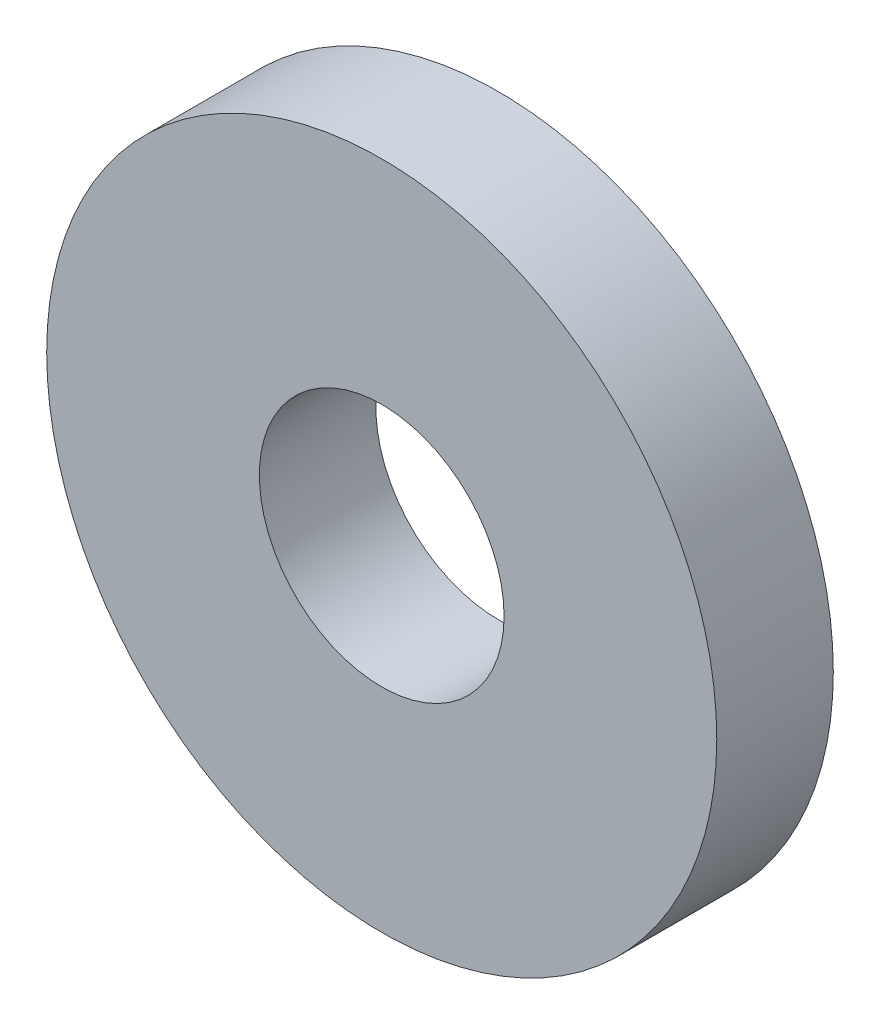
ISO-10303-21;
HEADER;
FILE_DESCRIPTION(('STEP AP214'),'2;1');
FILE_NAME('part.step','',(''),(''),'','','');
FILE_SCHEMA(('AUTOMOTIVE_DESIGN { 1 0 10303 214 1 1 1 1 }'));
ENDSEC;
DATA;
#1=APPLICATION_CONTEXT('core data for automotive mechanical design processes');
#2=APPLICATION_PROTOCOL_DEFINITION('international standard','automotive_design',2000,#1);
#3=PRODUCT_CONTEXT('',#1,'mechanical');
#4=PRODUCT('Part','Part','',(#3));
#5=PRODUCT_RELATED_PRODUCT_CATEGORY('part','',(#4));
#6=PRODUCT_DEFINITION_FORMATION('','',#4);
#7=PRODUCT_DEFINITION_CONTEXT('part definition',#1,'design');
#8=PRODUCT_DEFINITION('design','',#6,#7);
#9=PRODUCT_DEFINITION_SHAPE('','',#8);
#10=(LENGTH_UNIT() NAMED_UNIT(*) SI_UNIT(.MILLI.,.METRE.));
#11=(NAMED_UNIT(*) PLANE_ANGLE_UNIT() SI_UNIT($,.RADIAN.));
#12=(NAMED_UNIT(*) SI_UNIT($,.STERADIAN.) SOLID_ANGLE_UNIT());
#13=UNCERTAINTY_MEASURE_WITH_UNIT(LENGTH_MEASURE(1.E-05),#10,'distance_accuracy_value','');
#14=(GEOMETRIC_REPRESENTATION_CONTEXT(3) GLOBAL_UNCERTAINTY_ASSIGNED_CONTEXT((#13)) GLOBAL_UNIT_ASSIGNED_CONTEXT((#10,
#11,#12)) REPRESENTATION_CONTEXT('',''));
#15=CARTESIAN_POINT('',(0.,0.,0.));
#16=DIRECTION('',(0.,0.,1.));
#17=DIRECTION('',(1.,0.,0.));
#18=AXIS2_PLACEMENT_3D('',#15,#16,#17);
#19=CARTESIAN_POINT('',(0.,0.,4.));
#20=DIRECTION('',(0.,0.,1.));
#21=DIRECTION('',(1.,0.,0.));
#22=AXIS2_PLACEMENT_3D('',#19,#20,#21);
#23=PLANE('',#22);
#24=CARTESIAN_POINT('',(0.,0.,4.));
#25=DIRECTION('',(0.,0.,1.));
#26=DIRECTION('',(1.,0.,0.));
#27=AXIS2_PLACEMENT_3D('',#24,#25,#26);
#28=CIRCLE('',#27,11.5);
#29=CARTESIAN_POINT('',(11.5,0.,4.));
#30=VERTEX_POINT('',#29);
#31=EDGE_CURVE('E8',#30,#30,#28,.T.);
#32=ORIENTED_EDGE('',*,*,#31,.T.);
#33=EDGE_LOOP('',(#32));
#34=FACE_BOUND('',#33,.T.);
#35=CARTESIAN_POINT('',(0.,0.,4.));
#36=DIRECTION('',(0.,0.,1.));
#37=DIRECTION('',(1.,0.,0.));
#38=AXIS2_PLACEMENT_3D('',#35,#36,#37);
#39=CIRCLE('',#38,4.2);
#40=CARTESIAN_POINT('',(4.2,0.,4.));
#41=VERTEX_POINT('',#40);
#42=EDGE_CURVE('E23',#41,#41,#39,.T.);
#43=ORIENTED_EDGE('',*,*,#42,.F.);
#44=EDGE_LOOP('',(#43));
#45=FACE_BOUND('',#44,.T.);
#46=ADVANCED_FACE('F12',(#34,#45),#23,.T.);
#47=CARTESIAN_POINT('',(0.,0.,0.));
#48=DIRECTION('',(0.,0.,1.));
#49=DIRECTION('',(1.,0.,0.));
#50=AXIS2_PLACEMENT_3D('',#47,#48,#49);
#51=PLANE('',#50);
#52=CARTESIAN_POINT('',(0.,0.,0.));
#53=DIRECTION('',(0.,0.,1.));
#54=DIRECTION('',(1.,0.,0.));
#55=AXIS2_PLACEMENT_3D('',#52,#53,#54);
#56=CIRCLE('',#55,11.5);
#57=CARTESIAN_POINT('',(11.5,0.,0.));
#58=VERTEX_POINT('',#57);
#59=EDGE_CURVE('E19',#58,#58,#56,.T.);
#60=ORIENTED_EDGE('',*,*,#59,.F.);
#61=EDGE_LOOP('',(#60));
#62=FACE_BOUND('',#61,.T.);
#63=CARTESIAN_POINT('',(0.,0.,0.));
#64=DIRECTION('',(0.,0.,1.));
#65=DIRECTION('',(1.,0.,0.));
#66=AXIS2_PLACEMENT_3D('',#63,#64,#65);
#67=CIRCLE('',#66,4.2);
#68=CARTESIAN_POINT('',(4.2,0.,0.));
#69=VERTEX_POINT('',#68);
#70=EDGE_CURVE('E27',#69,#69,#67,.T.);
#71=ORIENTED_EDGE('',*,*,#70,.T.);
#72=EDGE_LOOP('',(#71));
#73=FACE_BOUND('',#72,.T.);
#74=ADVANCED_FACE('F33',(#62,#73),#51,.F.);
#75=CARTESIAN_POINT('',(0.,0.,4.));
#76=DIRECTION('',(0.,0.,-1.));
#77=DIRECTION('',(-1.,0.,0.));
#78=AXIS2_PLACEMENT_3D('',#75,#76,#77);
#79=CYLINDRICAL_SURFACE('',#78,11.5);
#80=ORIENTED_EDGE('',*,*,#31,.F.);
#81=EDGE_LOOP('',(#80));
#82=FACE_BOUND('',#81,.T.);
#83=ORIENTED_EDGE('',*,*,#59,.T.);
#84=EDGE_LOOP('',(#83));
#85=FACE_BOUND('',#84,.T.);
#86=ADVANCED_FACE('F14',(#82,#85),#79,.T.);
#87=CARTESIAN_POINT('',(0.,0.,4.));
#88=DIRECTION('',(0.,0.,-1.));
#89=DIRECTION('',(-1.,0.,0.));
#90=AXIS2_PLACEMENT_3D('',#87,#88,#89);
#91=CYLINDRICAL_SURFACE('',#90,4.2);
#92=ORIENTED_EDGE('',*,*,#42,.T.);
#93=EDGE_LOOP('',(#92));
#94=FACE_BOUND('',#93,.T.);
#95=ORIENTED_EDGE('',*,*,#70,.F.);
#96=EDGE_LOOP('',(#95));
#97=FACE_BOUND('',#96,.T.);
#98=ADVANCED_FACE('F35',(#94,#97),#91,.F.);
#99=CLOSED_SHELL('',(#46,#74,#86,#98));
#100=MANIFOLD_SOLID_BREP('B1',#99);
#101=ADVANCED_BREP_SHAPE_REPRESENTATION('',(#18,#100),#14);
#102=SHAPE_DEFINITION_REPRESENTATION(#9,#101);
ENDSEC;
END-ISO-10303-21;
